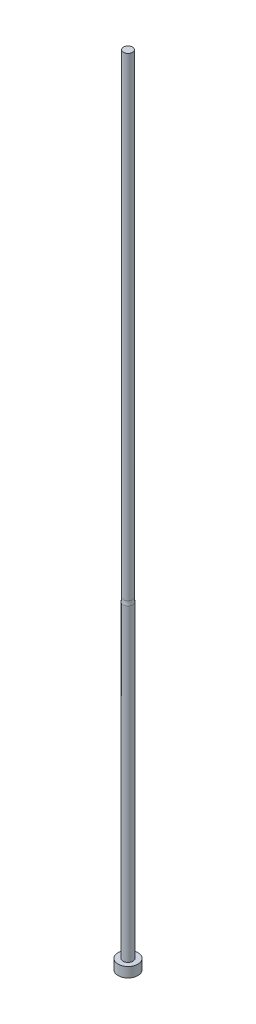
ISO-10303-21;
HEADER;
FILE_DESCRIPTION(('STEP AP214'),'2;1');
FILE_NAME('part.step','',(''),(''),'','','');
FILE_SCHEMA(('AUTOMOTIVE_DESIGN { 1 0 10303 214 1 1 1 1 }'));
ENDSEC;
DATA;
#1=APPLICATION_CONTEXT('core data for automotive mechanical design processes');
#2=APPLICATION_PROTOCOL_DEFINITION('international standard','automotive_design',2000,#1);
#3=PRODUCT_CONTEXT('',#1,'mechanical');
#4=PRODUCT('Part','Part','',(#3));
#5=PRODUCT_RELATED_PRODUCT_CATEGORY('part','',(#4));
#6=PRODUCT_DEFINITION_FORMATION('','',#4);
#7=PRODUCT_DEFINITION_CONTEXT('part definition',#1,'design');
#8=PRODUCT_DEFINITION('design','',#6,#7);
#9=PRODUCT_DEFINITION_SHAPE('','',#8);
#10=(LENGTH_UNIT() NAMED_UNIT(*) SI_UNIT(.MILLI.,.METRE.));
#11=(NAMED_UNIT(*) PLANE_ANGLE_UNIT() SI_UNIT($,.RADIAN.));
#12=(NAMED_UNIT(*) SI_UNIT($,.STERADIAN.) SOLID_ANGLE_UNIT());
#13=UNCERTAINTY_MEASURE_WITH_UNIT(LENGTH_MEASURE(1.E-05),#10,'distance_accuracy_value','');
#14=(GEOMETRIC_REPRESENTATION_CONTEXT(3) GLOBAL_UNCERTAINTY_ASSIGNED_CONTEXT((#13)) GLOBAL_UNIT_ASSIGNED_CONTEXT((#10,
#11,#12)) REPRESENTATION_CONTEXT('',''));
#15=CARTESIAN_POINT('',(0.,0.,0.));
#16=DIRECTION('',(0.,0.,1.));
#17=DIRECTION('',(1.,0.,0.));
#18=AXIS2_PLACEMENT_3D('',#15,#16,#17);
#19=CARTESIAN_POINT('',(0.,0.,0.));
#20=DIRECTION('',(0.,1.,0.));
#21=DIRECTION('',(-1.,0.,0.));
#22=AXIS2_PLACEMENT_3D('',#19,#20,#21);
#23=PLANE('',#22);
#24=CARTESIAN_POINT('',(0.,0.,0.));
#25=DIRECTION('',(0.,1.,0.));
#26=DIRECTION('',(-1.,0.,0.));
#27=AXIS2_PLACEMENT_3D('',#24,#25,#26);
#28=CIRCLE('',#27,3.175);
#29=CARTESIAN_POINT('',(-3.175,0.,0.));
#30=VERTEX_POINT('',#29);
#31=EDGE_CURVE('E37',#30,#30,#28,.T.);
#32=ORIENTED_EDGE('',*,*,#31,.F.);
#33=EDGE_LOOP('',(#32));
#34=FACE_BOUND('',#33,.T.);
#35=ADVANCED_FACE('F30',(#34),#23,.F.);
#36=CARTESIAN_POINT('',(0.,254.,0.));
#37=DIRECTION('',(0.,1.,0.));
#38=DIRECTION('',(-1.,0.,0.));
#39=AXIS2_PLACEMENT_3D('',#36,#37,#38);
#40=CYLINDRICAL_SURFACE('',#39,3.175);
#41=CARTESIAN_POINT('',(0.,3.17499999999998,0.));
#42=DIRECTION('',(0.,1.,0.));
#43=DIRECTION('',(-1.,0.,0.));
#44=AXIS2_PLACEMENT_3D('',#41,#42,#43);
#45=CIRCLE('',#44,3.175);
#46=CARTESIAN_POINT('',(-3.175,3.17499999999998,0.));
#47=VERTEX_POINT('',#46);
#48=EDGE_CURVE('E41',#47,#47,#45,.T.);
#49=ORIENTED_EDGE('',*,*,#48,.F.);
#50=EDGE_LOOP('',(#49));
#51=FACE_BOUND('',#50,.T.);
#52=ORIENTED_EDGE('',*,*,#31,.T.);
#53=EDGE_LOOP('',(#52));
#54=FACE_BOUND('',#53,.T.);
#55=ADVANCED_FACE('F72',(#51,#54),#40,.T.);
#56=CARTESIAN_POINT('',(3.175,3.175,0.));
#57=DIRECTION('',(0.,-1.,0.));
#58=DIRECTION('',(1.,0.,0.));
#59=AXIS2_PLACEMENT_3D('',#56,#57,#58);
#60=PLANE('',#59);
#61=CARTESIAN_POINT('',(0.,3.17499999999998,0.));
#62=DIRECTION('',(0.,1.,0.));
#63=DIRECTION('',(-1.,0.,0.));
#64=AXIS2_PLACEMENT_3D('',#61,#62,#63);
#65=CIRCLE('',#64,1.58750000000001);
#66=CARTESIAN_POINT('',(-1.58750000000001,3.17499999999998,0.));
#67=VERTEX_POINT('',#66);
#68=EDGE_CURVE('E45',#67,#67,#65,.T.);
#69=ORIENTED_EDGE('',*,*,#68,.F.);
#70=EDGE_LOOP('',(#69));
#71=FACE_BOUND('',#70,.T.);
#72=ORIENTED_EDGE('',*,*,#48,.T.);
#73=EDGE_LOOP('',(#72));
#74=FACE_BOUND('',#73,.T.);
#75=ADVANCED_FACE('F68',(#71,#74),#60,.F.);
#76=CARTESIAN_POINT('',(0.,254.,0.));
#77=DIRECTION('',(0.,1.,0.));
#78=DIRECTION('',(-1.,0.,0.));
#79=AXIS2_PLACEMENT_3D('',#76,#77,#78);
#80=CYLINDRICAL_SURFACE('',#79,1.58750000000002);
#81=CARTESIAN_POINT('',(0.,101.6,0.));
#82=DIRECTION('',(0.,1.,0.));
#83=DIRECTION('',(-1.,0.,0.));
#84=AXIS2_PLACEMENT_3D('',#81,#82,#83);
#85=CIRCLE('',#84,1.58750000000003);
#86=CARTESIAN_POINT('',(-1.58750000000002,101.6,0.));
#87=VERTEX_POINT('',#86);
#88=EDGE_CURVE('E50',#87,#87,#85,.T.);
#89=ORIENTED_EDGE('',*,*,#88,.F.);
#90=EDGE_LOOP('',(#89));
#91=FACE_BOUND('',#90,.T.);
#92=ORIENTED_EDGE('',*,*,#68,.T.);
#93=EDGE_LOOP('',(#92));
#94=FACE_BOUND('',#93,.T.);
#95=ADVANCED_FACE('F61',(#91,#94),#80,.T.);
#96=CARTESIAN_POINT('',(0.,254.,0.));
#97=DIRECTION('',(0.,1.,0.));
#98=DIRECTION('',(-1.,0.,0.));
#99=AXIS2_PLACEMENT_3D('',#96,#97,#98);
#100=CYLINDRICAL_SURFACE('',#99,1.45161000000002);
#101=CARTESIAN_POINT('',(0.,102.906651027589,0.));
#102=DIRECTION('',(0.,-1.,0.));
#103=DIRECTION('',(1.,0.,0.));
#104=AXIS2_PLACEMENT_3D('',#101,#102,#103);
#105=CIRCLE('',#104,1.45161000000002);
#106=CARTESIAN_POINT('',(1.45161000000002,102.906651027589,0.));
#107=VERTEX_POINT('',#106);
#108=EDGE_CURVE('E10',#107,#107,#105,.F.);
#109=ORIENTED_EDGE('',*,*,#108,.T.);
#110=EDGE_LOOP('',(#109));
#111=FACE_BOUND('',#110,.T.);
#112=CARTESIAN_POINT('',(0.,254.,0.));
#113=DIRECTION('',(0.,1.,0.));
#114=DIRECTION('',(-1.,0.,0.));
#115=AXIS2_PLACEMENT_3D('',#112,#113,#114);
#116=CIRCLE('',#115,1.45161000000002);
#117=CARTESIAN_POINT('',(-1.45161,254.,0.));
#118=VERTEX_POINT('',#117);
#119=EDGE_CURVE('E53',#118,#118,#116,.T.);
#120=ORIENTED_EDGE('',*,*,#119,.F.);
#121=EDGE_LOOP('',(#120));
#122=FACE_BOUND('',#121,.T.);
#123=ADVANCED_FACE('F59',(#111,#122),#100,.T.);
#124=CARTESIAN_POINT('',(1.45161000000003,254.,0.));
#125=DIRECTION('',(0.,-1.,0.));
#126=DIRECTION('',(1.,0.,0.));
#127=AXIS2_PLACEMENT_3D('',#124,#125,#126);
#128=PLANE('',#127);
#129=ORIENTED_EDGE('',*,*,#119,.T.);
#130=EDGE_LOOP('',(#129));
#131=FACE_BOUND('',#130,.T.);
#132=ADVANCED_FACE('F57',(#131),#128,.F.);
#133=CARTESIAN_POINT('',(0.,102.906651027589,0.));
#134=DIRECTION('',(0.,-1.,0.));
#135=DIRECTION('',(1.,0.,0.));
#136=AXIS2_PLACEMENT_3D('',#133,#134,#135);
#137=TOROIDAL_SURFACE('',#136,7.80161000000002,6.35);
#138=ORIENTED_EDGE('',*,*,#88,.T.);
#139=EDGE_LOOP('',(#138));
#140=FACE_BOUND('',#139,.T.);
#141=ORIENTED_EDGE('',*,*,#108,.F.);
#142=EDGE_LOOP('',(#141));
#143=FACE_BOUND('',#142,.T.);
#144=ADVANCED_FACE('F32',(#140,#143),#137,.F.);
#145=CLOSED_SHELL('',(#35,#55,#75,#95,#123,#132,#144));
#146=MANIFOLD_SOLID_BREP('B2',#145);
#147=ADVANCED_BREP_SHAPE_REPRESENTATION('',(#18,#146),#14);
#148=SHAPE_DEFINITION_REPRESENTATION(#9,#147);
ENDSEC;
END-ISO-10303-21;
